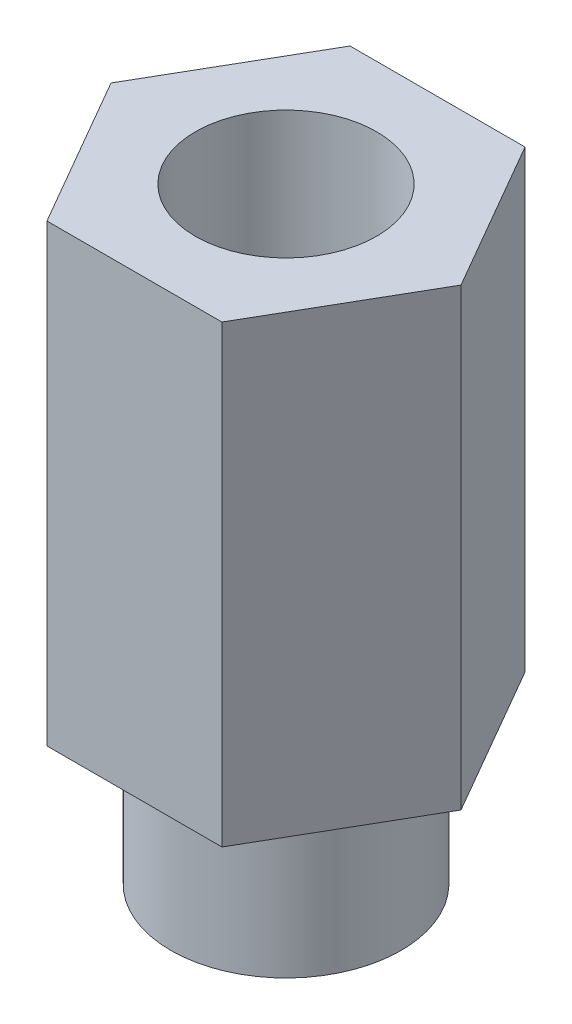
from build123d import *

# Parameters (mm, degrees)
SKETCH1_R                  = 2.413
BOSS_EXTRUDE1_DEPTH        = 3.175
BOSS_EXTRUDE2_DEPTH        = 9.525
F_10_24_TAPPED_HOLE1_D     = 3.7973
F_10_24_TAPPED_HOLE1_DEPTH = 9.525
F_10_24_TAPPED_HOLE1_TIP   = 1.140824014


with BuildPart() as part:
    # Sketch1 → Boss-Extrude1 (new body)
    with BuildSketch(Plane(origin=(0, 0, 0), x_dir=(1, 0, 0), z_dir=(0, 1, 0))):
        with Locations(Location((0, 0, 0), (0, 0, 270))):
            Circle(SKETCH1_R)
    extrude(amount=-BOSS_EXTRUDE1_DEPTH)

    # Sketch2 → Boss-Extrude2 (add)
    with BuildSketch(Plane(origin=(0, 0, 0), x_dir=(1, 0, 0), z_dir=(0, 1, 0))):
        Polygon((3.666174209, 0), (1.833087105, 3.175), (-1.833087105, 3.175), (-3.666174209, 0), (-1.833087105, -3.175), (1.833087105, -3.175), align=None)
    extrude(amount=BOSS_EXTRUDE2_DEPTH)

    # 10-24 Tapped Hole1
    with Locations(Plane(origin=(0, 9.525, 0), x_dir=(-1, 0, 0), z_dir=(0, 1, 0))):
        with Locations((0, 0)):
            Hole(F_10_24_TAPPED_HOLE1_D / 2, depth=F_10_24_TAPPED_HOLE1_DEPTH)
            with Locations((0, 0, -(F_10_24_TAPPED_HOLE1_DEPTH + F_10_24_TAPPED_HOLE1_TIP / 2))):  # 118° drill point
                Cone(0, F_10_24_TAPPED_HOLE1_D / 2, F_10_24_TAPPED_HOLE1_TIP, mode=Mode.SUBTRACT)


solid = part.part
